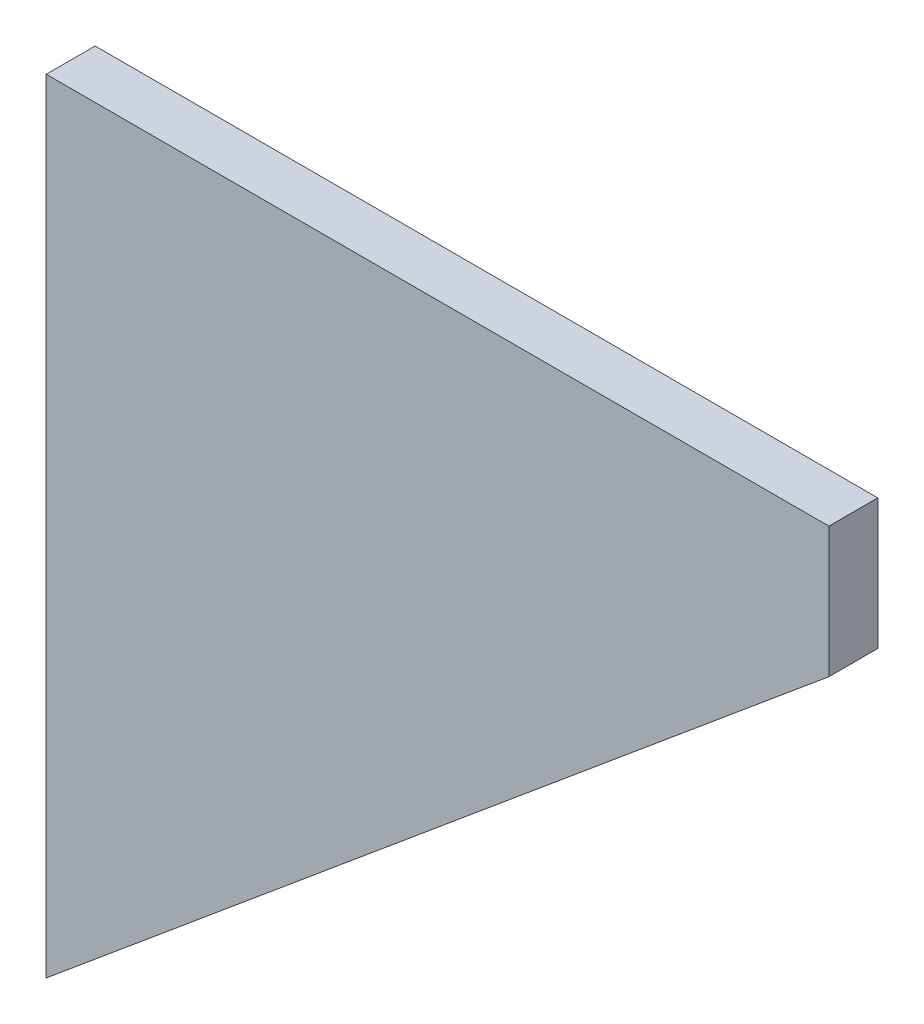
from build123d import *

# Parameters (mm, degrees)
EXTRUDE1_DEPTH = 9.525


with BuildPart() as part:
    # Sketch1 → Extrude1 (new body)
    with BuildSketch(Plane.XY):
        Polygon((0, 0), (0, -152.4), (152.4, -25.4), (152.4, 0), align=None)
    extrude(amount=EXTRUDE1_DEPTH)


solid = part.part
